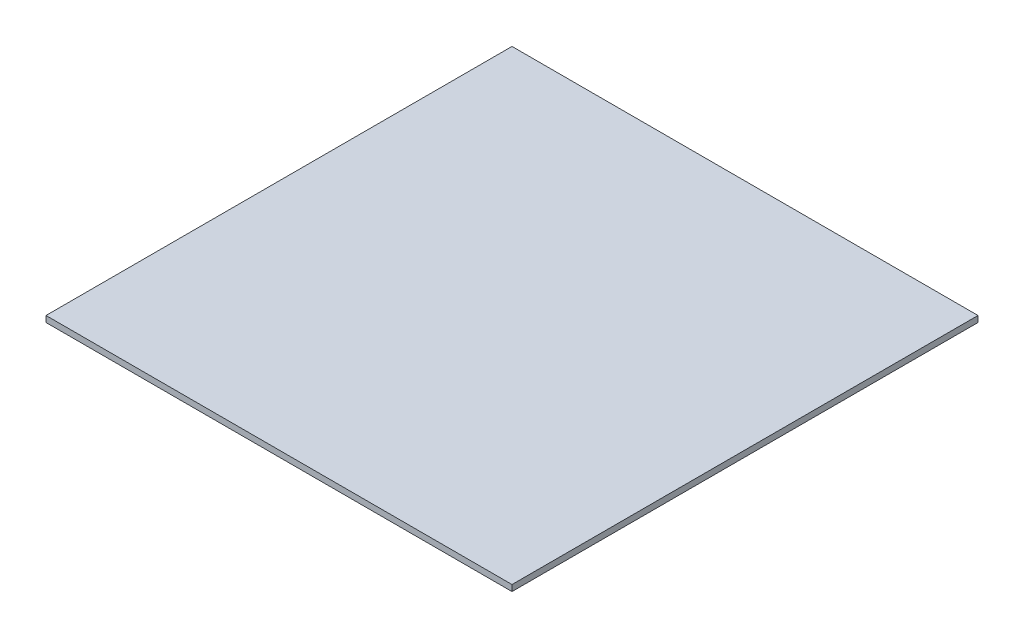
from build123d import *

# Parameters (mm, degrees)
SKETCH1_W           = 304.8
SKETCH1_H           = 304.8
BOSS_EXTRUDE1_DEPTH = 4


with BuildPart() as part:
    # Sketch1 → Boss-Extrude1 (new body)
    with BuildSketch(Plane(origin=(0, 0, 0), x_dir=(1, 0, 0), z_dir=(0, 1, 0))):
        Rectangle(SKETCH1_W, SKETCH1_H)
    extrude(amount=BOSS_EXTRUDE1_DEPTH)


solid = part.part
